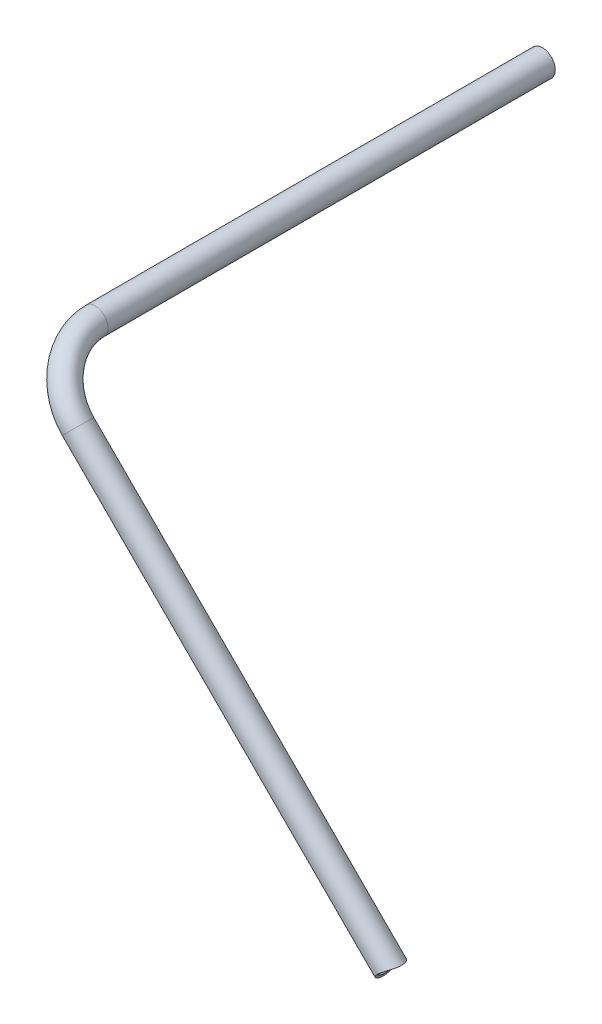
ISO-10303-21;
HEADER;
FILE_DESCRIPTION(('STEP AP214'),'2;1');
FILE_NAME('part.step','',(''),(''),'','','');
FILE_SCHEMA(('AUTOMOTIVE_DESIGN { 1 0 10303 214 1 1 1 1 }'));
ENDSEC;
DATA;
#1=APPLICATION_CONTEXT('core data for automotive mechanical design processes');
#2=APPLICATION_PROTOCOL_DEFINITION('international standard','automotive_design',2000,#1);
#3=PRODUCT_CONTEXT('',#1,'mechanical');
#4=PRODUCT('Part','Part','',(#3));
#5=PRODUCT_RELATED_PRODUCT_CATEGORY('part','',(#4));
#6=PRODUCT_DEFINITION_FORMATION('','',#4);
#7=PRODUCT_DEFINITION_CONTEXT('part definition',#1,'design');
#8=PRODUCT_DEFINITION('design','',#6,#7);
#9=PRODUCT_DEFINITION_SHAPE('','',#8);
#10=(LENGTH_UNIT() NAMED_UNIT(*) SI_UNIT(.MILLI.,.METRE.));
#11=(NAMED_UNIT(*) PLANE_ANGLE_UNIT() SI_UNIT($,.RADIAN.));
#12=(NAMED_UNIT(*) SI_UNIT($,.STERADIAN.) SOLID_ANGLE_UNIT());
#13=UNCERTAINTY_MEASURE_WITH_UNIT(LENGTH_MEASURE(1.E-05),#10,'distance_accuracy_value','');
#14=(GEOMETRIC_REPRESENTATION_CONTEXT(3) GLOBAL_UNCERTAINTY_ASSIGNED_CONTEXT((#13)) GLOBAL_UNIT_ASSIGNED_CONTEXT((#10,
#11,#12)) REPRESENTATION_CONTEXT('',''));
#15=CARTESIAN_POINT('',(0.,0.,0.));
#16=DIRECTION('',(0.,0.,1.));
#17=DIRECTION('',(1.,0.,0.));
#18=AXIS2_PLACEMENT_3D('',#15,#16,#17);
#19=CARTESIAN_POINT('',(388.537786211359,-388.537786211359,525.326301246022));
#20=DIRECTION('',(-0.707106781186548,0.707106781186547,0.));
#21=DIRECTION('',(-0.707106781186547,-0.707106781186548,0.));
#22=AXIS2_PLACEMENT_3D('',#19,#20,#21);
#23=CYLINDRICAL_SURFACE('',#22,13.3349999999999);
#24=CARTESIAN_POINT('',(43.1052293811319,-43.1052293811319,525.326301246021));
#25=DIRECTION('',(0.707106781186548,-0.707106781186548,0.));
#26=DIRECTION('',(0.500000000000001,0.5,-0.707106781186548));
#27=AXIS2_PLACEMENT_3D('',#24,#25,#26);
#28=CIRCLE('',#27,13.335);
#29=CARTESIAN_POINT('',(43.1052293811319,-43.1052293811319,538.661301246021));
#30=VERTEX_POINT('',#29);
#31=EDGE_CURVE('E50',#30,#30,#28,.T.);
#32=ORIENTED_EDGE('',*,*,#31,.T.);
#33=EDGE_LOOP('',(#32));
#34=FACE_BOUND('',#33,.T.);
#35=CARTESIAN_POINT('',(378.786480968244,-359.927943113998,525.326301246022));
#36=CARTESIAN_POINT('',(378.786476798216,-359.927942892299,524.972757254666));
#37=CARTESIAN_POINT('',(378.771620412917,-359.932994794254,524.619113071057));
#38=CARTESIAN_POINT('',(378.712467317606,-359.953260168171,523.914436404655));
#39=CARTESIAN_POINT('',(378.668152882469,-359.968479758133,523.563405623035));
#40=CARTESIAN_POINT('',(378.55080796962,-360.00928814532,522.865966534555));
#41=CARTESIAN_POINT('',(378.477712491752,-360.034900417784,522.519570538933));
#42=CARTESIAN_POINT('',(378.30418213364,-360.096743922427,521.834740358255));
#43=CARTESIAN_POINT('',(378.203751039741,-360.132973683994,521.496305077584));
#44=CARTESIAN_POINT('',(377.97777558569,-360.216210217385,520.831004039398));
#45=CARTESIAN_POINT('',(377.852344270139,-360.263168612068,520.504093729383));
#46=CARTESIAN_POINT('',(377.578031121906,-360.368362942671,519.862152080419));
#47=CARTESIAN_POINT('',(377.429148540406,-360.426599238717,519.547121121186));
#48=CARTESIAN_POINT('',(377.110073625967,-360.554791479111,518.930717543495));
#49=CARTESIAN_POINT('',(376.939890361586,-360.624742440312,518.629339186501));
#50=CARTESIAN_POINT('',(376.580219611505,-360.776917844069,518.041435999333));
#51=CARTESIAN_POINT('',(376.390725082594,-360.859146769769,517.754916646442));
#52=CARTESIAN_POINT('',(375.982044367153,-361.042011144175,517.180503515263));
#53=CARTESIAN_POINT('',(375.761737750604,-361.143482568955,516.893672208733));
#54=CARTESIAN_POINT('',(375.304266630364,-361.361523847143,516.339871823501));
#55=CARTESIAN_POINT('',(375.067101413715,-361.478094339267,516.072903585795));
#56=CARTESIAN_POINT('',(374.578273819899,-361.726998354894,515.560113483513));
#57=CARTESIAN_POINT('',(374.326603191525,-361.859340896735,515.314303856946));
#58=CARTESIAN_POINT('',(373.811479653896,-362.14019172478,514.845517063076));
#59=CARTESIAN_POINT('',(373.548030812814,-362.288694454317,514.622532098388));
#60=CARTESIAN_POINT('',(372.998369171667,-362.610119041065,514.190193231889));
#61=CARTESIAN_POINT('',(372.71167672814,-362.783890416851,513.982077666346));
#62=CARTESIAN_POINT('',(372.130950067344,-363.149903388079,513.594196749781));
#63=CARTESIAN_POINT('',(371.836915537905,-363.342145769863,513.414432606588));
#64=CARTESIAN_POINT('',(371.244688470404,-363.74488380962,513.084998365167));
#65=CARTESIAN_POINT('',(370.946497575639,-363.95537241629,512.935316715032));
#66=CARTESIAN_POINT('',(370.349003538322,-364.394120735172,512.667548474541));
#67=CARTESIAN_POINT('',(370.049700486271,-364.62237903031,512.549459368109));
#68=CARTESIAN_POINT('',(369.47031871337,-365.082050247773,512.352094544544));
#69=CARTESIAN_POINT('',(369.190124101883,-365.312527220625,512.270977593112));
#70=CARTESIAN_POINT('',(368.63420767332,-365.78713399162,512.13894395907));
#71=CARTESIAN_POINT('',(368.358485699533,-366.031263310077,512.088026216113));
#72=CARTESIAN_POINT('',(367.814165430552,-366.531442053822,512.017014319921));
#73=CARTESIAN_POINT('',(367.54556440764,-366.787486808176,511.996908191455));
#74=CARTESIAN_POINT('',(367.017737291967,-367.309589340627,511.987731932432));
#75=CARTESIAN_POINT('',(366.758510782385,-367.575646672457,511.998660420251));
#76=CARTESIAN_POINT('',(366.268813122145,-368.097066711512,512.049609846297));
#77=CARTESIAN_POINT('',(366.03758643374,-368.351921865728,512.087596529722));
#78=CARTESIAN_POINT('',(365.586503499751,-368.866316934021,512.189986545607));
#79=CARTESIAN_POINT('',(365.366646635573,-369.125856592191,512.254388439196));
#80=CARTESIAN_POINT('',(364.939421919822,-369.647525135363,512.40896235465));
#81=CARTESIAN_POINT('',(364.73205448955,-369.909654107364,512.499135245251));
#82=CARTESIAN_POINT('',(364.33064269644,-370.43434993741,512.704401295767));
#83=CARTESIAN_POINT('',(364.13659875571,-370.69691680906,512.819495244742));
#84=CARTESIAN_POINT('',(363.759536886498,-371.224319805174,513.075538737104));
#85=CARTESIAN_POINT('',(363.576731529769,-371.489129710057,513.216854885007));
#86=CARTESIAN_POINT('',(363.225711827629,-372.014776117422,513.523000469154));
#87=CARTESIAN_POINT('',(363.057497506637,-372.275612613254,513.687829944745));
#88=CARTESIAN_POINT('',(362.735689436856,-372.791191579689,514.039835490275));
#89=CARTESIAN_POINT('',(362.582097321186,-373.045933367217,514.22701405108));
#90=CARTESIAN_POINT('',(362.289352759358,-373.547284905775,514.622577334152));
#91=CARTESIAN_POINT('',(362.150205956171,-373.793891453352,514.830970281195));
#92=CARTESIAN_POINT('',(361.87587783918,-374.295537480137,515.284657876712));
#93=CARTESIAN_POINT('',(361.741839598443,-374.549749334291,515.531560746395));
#94=CARTESIAN_POINT('',(361.489742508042,-375.043665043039,516.047085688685));
#95=CARTESIAN_POINT('',(361.371684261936,-375.283368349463,516.315708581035));
#96=CARTESIAN_POINT('',(361.150897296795,-375.745793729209,516.873322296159));
#97=CARTESIAN_POINT('',(361.048174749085,-375.968508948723,517.162321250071));
#98=CARTESIAN_POINT('',(360.857450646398,-376.394288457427,517.759126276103));
#99=CARTESIAN_POINT('',(360.769451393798,-376.597349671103,518.066935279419));
#100=CARTESIAN_POINT('',(360.604223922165,-376.989011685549,518.712651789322));
#101=CARTESIAN_POINT('',(360.527582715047,-377.176682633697,519.051275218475));
#102=CARTESIAN_POINT('',(360.388881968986,-377.52482171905,519.744917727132));
#103=CARTESIAN_POINT('',(360.326815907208,-377.685302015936,520.099929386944));
#104=CARTESIAN_POINT('',(360.216606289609,-377.976249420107,520.823983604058));
#105=CARTESIAN_POINT('',(360.168456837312,-378.106729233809,521.193020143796));
#106=CARTESIAN_POINT('',(360.085510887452,-378.335143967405,521.942491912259));
#107=CARTESIAN_POINT('',(360.050713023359,-378.433082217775,522.322925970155));
#108=CARTESIAN_POINT('',(359.996036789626,-378.588619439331,523.065066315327));
#109=CARTESIAN_POINT('',(359.975283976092,-378.648563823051,523.426217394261));
#110=CARTESIAN_POINT('',(359.944738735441,-378.737228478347,524.152795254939));
#111=CARTESIAN_POINT('',(359.934945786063,-378.76595023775,524.518221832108));
#112=CARTESIAN_POINT('',(359.926212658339,-378.791550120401,525.250184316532));
#113=CARTESIAN_POINT('',(359.927268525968,-378.788439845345,525.61671977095));
#114=CARTESIAN_POINT('',(359.940235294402,-378.750469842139,526.347938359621));
#115=CARTESIAN_POINT('',(359.952145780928,-378.715611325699,526.712621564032));
#116=CARTESIAN_POINT('',(359.985632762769,-378.618713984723,527.409679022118));
#117=CARTESIAN_POINT('',(360.006409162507,-378.558932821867,527.742408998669));
#118=CARTESIAN_POINT('',(360.057535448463,-378.413938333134,528.401502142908));
#119=CARTESIAN_POINT('',(360.087884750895,-378.328726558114,528.727865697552));
#120=CARTESIAN_POINT('',(360.158423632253,-378.134251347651,529.372241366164));
#121=CARTESIAN_POINT('',(360.198613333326,-378.024987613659,529.690253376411));
#122=CARTESIAN_POINT('',(360.289183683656,-377.783991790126,530.31627542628));
#123=CARTESIAN_POINT('',(360.339568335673,-377.652250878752,530.624281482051));
#124=CARTESIAN_POINT('',(360.453365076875,-377.361841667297,531.241939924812));
#125=CARTESIAN_POINT('',(360.517253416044,-377.20224256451,531.551066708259));
#126=CARTESIAN_POINT('',(360.657078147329,-376.862559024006,532.155170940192));
#127=CARTESIAN_POINT('',(360.733019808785,-376.682465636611,532.450142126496));
#128=CARTESIAN_POINT('',(360.8974737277,-376.303948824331,533.024471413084));
#129=CARTESIAN_POINT('',(360.985988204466,-376.105522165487,533.303826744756));
#130=CARTESIAN_POINT('',(361.176115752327,-375.692485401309,533.845609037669));
#131=CARTESIAN_POINT('',(361.277729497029,-375.477874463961,534.108035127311));
#132=CARTESIAN_POINT('',(361.504737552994,-375.013801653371,534.638483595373));
#133=CARTESIAN_POINT('',(361.631467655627,-374.762958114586,534.904729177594));
#134=CARTESIAN_POINT('',(361.901788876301,-374.247249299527,535.413869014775));
#135=CARTESIAN_POINT('',(362.045374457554,-373.982388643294,535.656770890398));
#136=CARTESIAN_POINT('',(362.349992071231,-373.441198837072,536.117844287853));
#137=CARTESIAN_POINT('',(362.511030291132,-373.16486564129,536.336006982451));
#138=CARTESIAN_POINT('',(362.850814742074,-372.603603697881,536.745900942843));
#139=CARTESIAN_POINT('',(363.029560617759,-372.318675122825,536.937632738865));
#140=CARTESIAN_POINT('',(363.406288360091,-371.740799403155,537.29446974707));
#141=CARTESIAN_POINT('',(363.60441025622,-371.447806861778,537.459354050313));
#142=CARTESIAN_POINT('',(364.018407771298,-370.858966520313,537.759070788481));
#143=CARTESIAN_POINT('',(364.234283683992,-370.563118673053,537.893902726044));
#144=CARTESIAN_POINT('',(364.682954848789,-369.971802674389,538.131985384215));
#145=CARTESIAN_POINT('',(364.915740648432,-369.676334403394,538.235253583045));
#146=CARTESIAN_POINT('',(365.39715952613,-369.088706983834,538.409069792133));
#147=CARTESIAN_POINT('',(365.645791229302,-368.796547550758,538.479620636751));
#148=CARTESIAN_POINT('',(366.137616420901,-368.240730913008,538.582983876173));
#149=CARTESIAN_POINT('',(366.379763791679,-367.976606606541,538.618276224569));
#150=CARTESIAN_POINT('',(366.874510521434,-367.455981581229,538.65980981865));
#151=CARTESIAN_POINT('',(367.127109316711,-367.199480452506,538.666052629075));
#152=CARTESIAN_POINT('',(367.640776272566,-366.696189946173,538.64941768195));
#153=CARTESIAN_POINT('',(367.901842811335,-366.44939872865,538.626545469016));
#154=CARTESIAN_POINT('',(368.430327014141,-365.967250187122,538.551954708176));
#155=CARTESIAN_POINT('',(368.697744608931,-365.731892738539,538.500236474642));
#156=CARTESIAN_POINT('',(369.224912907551,-365.284003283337,538.371394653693));
#157=CARTESIAN_POINT('',(369.484493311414,-365.070924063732,538.295469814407));
#158=CARTESIAN_POINT('',(370.00523024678,-364.657544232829,538.118496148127));
#159=CARTESIAN_POINT('',(370.266386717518,-364.457243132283,538.017448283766));
#160=CARTESIAN_POINT('',(370.788194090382,-364.070080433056,537.791123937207));
#161=CARTESIAN_POINT('',(371.048844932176,-363.883220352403,537.6658447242));
#162=CARTESIAN_POINT('',(371.567523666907,-363.523372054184,537.392090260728));
#163=CARTESIAN_POINT('',(371.825551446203,-363.350384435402,537.243614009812));
#164=CARTESIAN_POINT('',(372.348598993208,-363.010881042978,536.91727856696));
#165=CARTESIAN_POINT('',(372.613400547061,-362.845020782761,536.73838775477));
#166=CARTESIAN_POINT('',(373.135678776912,-362.528567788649,536.357667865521));
#167=CARTESIAN_POINT('',(373.393152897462,-362.37798033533,536.155830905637));
#168=CARTESIAN_POINT('',(373.898493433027,-362.091869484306,535.730511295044));
#169=CARTESIAN_POINT('',(374.146358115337,-361.956348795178,535.507024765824));
#170=CARTESIAN_POINT('',(374.630231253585,-361.700014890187,535.039698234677));
#171=CARTESIAN_POINT('',(374.866239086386,-361.579202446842,534.795857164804));
#172=CARTESIAN_POINT('',(375.342017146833,-361.342958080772,534.269353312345));
#173=CARTESIAN_POINT('',(375.580652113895,-361.228675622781,533.98514614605));
#174=CARTESIAN_POINT('',(376.038738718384,-361.016001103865,533.396233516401));
#175=CARTESIAN_POINT('',(376.258196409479,-360.91760402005,533.091534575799));
#176=CARTESIAN_POINT('',(376.67540122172,-360.73586669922,532.462937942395));
#177=CARTESIAN_POINT('',(376.873129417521,-360.652539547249,532.139023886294));
#178=CARTESIAN_POINT('',(377.243817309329,-360.500355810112,531.474078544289));
#179=CARTESIAN_POINT('',(377.416778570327,-360.431498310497,531.133048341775));
#180=CARTESIAN_POINT('',(377.735581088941,-360.307433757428,530.434997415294));
#181=CARTESIAN_POINT('',(377.881349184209,-360.252263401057,530.077936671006));
#182=CARTESIAN_POINT('',(378.142552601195,-360.155227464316,529.351028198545));
#183=CARTESIAN_POINT('',(378.25798270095,-360.113364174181,528.981178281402));
#184=CARTESIAN_POINT('',(378.455823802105,-360.042591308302,528.232724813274));
#185=CARTESIAN_POINT('',(378.538332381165,-360.013643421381,527.854150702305));
#186=CARTESIAN_POINT('',(378.66893938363,-359.968190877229,527.090572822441));
#187=CARTESIAN_POINT('',(378.717063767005,-359.951676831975,526.705574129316));
#188=CARTESIAN_POINT('',(378.760454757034,-359.936824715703,526.154045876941));
#189=CARTESIAN_POINT('',(378.770208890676,-359.933493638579,525.988676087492));
#190=CARTESIAN_POINT('',(378.783223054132,-359.929052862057,525.657645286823));
#191=CARTESIAN_POINT('',(378.786482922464,-359.927943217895,525.491984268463));
#192=CARTESIAN_POINT('',(378.786480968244,-359.927943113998,525.326301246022));
#193=B_SPLINE_CURVE_WITH_KNOTS('',3,(#35,#36,#37,#38,#39,#40,#41,#42,#43,#44,#45,#46,#47,#48,
#49,#50,#51,#52,#53,#54,#55,#56,#57,#58,#59,#60,#61,#62,#63,#64,#65,#66,#67,#68,#69,#70,#71,#72,
#73,#74,#75,#76,#77,#78,#79,#80,#81,#82,#83,#84,#85,#86,#87,#88,#89,#90,#91,#92,#93,#94,#95,#96,
#97,#98,#99,#100,#101,#102,#103,#104,#105,#106,#107,#108,#109,#110,#111,#112,#113,#114,#115,
#116,#117,#118,#119,#120,#121,#122,#123,#124,#125,#126,#127,#128,#129,#130,#131,#132,#133,#134,
#135,#136,#137,#138,#139,#140,#141,#142,#143,#144,#145,#146,#147,#148,#149,#150,#151,#152,#153,
#154,#155,#156,#157,#158,#159,#160,#161,#162,#163,#164,#165,#166,#167,#168,#169,#170,#171,#172,
#173,#174,#175,#176,#177,#178,#179,#180,#181,#182,#183,#184,#185,#186,#187,#188,#189,#190,#191,
#192),.UNSPECIFIED.,.T.,.F.,(4,2,2,2,2,2,2,2,2,2,2,2,2,2,2,2,2,2,2,2,2,2,2,2,2,2,2,2,2,2,2,2,2,
2,2,2,2,2,2,2,2,2,2,2,2,2,2,2,2,2,2,2,2,2,2,2,2,2,2,2,2,2,2,2,2,2,2,2,2,2,2,2,2,2,2,2,2,2,4),
(0.,1.06046028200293,2.12155922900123,3.18506847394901,4.24843048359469,5.30708908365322,
6.36578149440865,7.42402470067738,8.48265526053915,9.60834023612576,10.7340728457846,
11.860452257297,12.9864455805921,14.1687172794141,15.3510393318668,16.5329064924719,
17.7146794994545,18.8285054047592,19.9422921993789,21.055646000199,22.1689502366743,
23.2063519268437,24.2436971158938,25.2810772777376,26.318490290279,27.371680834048,
28.4248731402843,29.4781829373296,30.5319026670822,31.6672855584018,32.8027113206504,
33.9385927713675,35.0746516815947,36.2571292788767,37.4390766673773,38.6205225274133,
39.801847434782,40.9004103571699,41.9989209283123,43.0970311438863,44.1950994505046,
45.2100319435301,46.2249025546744,47.2397857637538,48.2550682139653,49.3150925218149,
50.3755815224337,51.436257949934,52.4969889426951,53.6570410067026,54.8167130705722,
55.9767976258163,57.1368589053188,58.3060296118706,59.475219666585,60.6437611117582,
61.8122013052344,62.8910022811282,63.9697451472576,65.0482826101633,66.1268083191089,
67.1585714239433,68.1902950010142,69.2221349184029,70.2540193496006,71.33298987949,
72.412332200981,73.491868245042,74.5714609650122,75.7350282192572,76.898226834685,
78.0624306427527,79.2265608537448,80.3937793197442,81.5611985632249,82.72513146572,
83.8881846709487,84.3851409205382,84.8821095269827),.UNSPECIFIED.);
#194=CARTESIAN_POINT('',(378.786480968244,-359.927943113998,525.326301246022));
#195=VERTEX_POINT('',#194);
#196=EDGE_CURVE('E59',#195,#195,#193,.T.);
#197=ORIENTED_EDGE('',*,*,#196,.T.);
#198=EDGE_LOOP('',(#197));
#199=FACE_BOUND('',#198,.T.);
#200=ADVANCED_FACE('F29',(#34,#199),#23,.T.);
#201=CARTESIAN_POINT('',(388.537786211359,-388.537786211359,525.326301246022));
#202=DIRECTION('',(-0.707106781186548,0.707106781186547,0.));
#203=DIRECTION('',(-0.707106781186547,-0.707106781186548,0.));
#204=AXIS2_PLACEMENT_3D('',#201,#202,#203);
#205=CYLINDRICAL_SURFACE('',#204,10.4648);
#206=CARTESIAN_POINT('',(43.1052293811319,-43.1052293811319,525.326301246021));
#207=DIRECTION('',(0.707106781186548,-0.707106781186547,0.));
#208=DIRECTION('',(0.707106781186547,0.707106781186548,0.));
#209=AXIS2_PLACEMENT_3D('',#206,#207,#208);
#210=CIRCLE('',#209,10.4648);
#211=CARTESIAN_POINT('',(43.1052293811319,-43.1052293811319,535.791101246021));
#212=VERTEX_POINT('',#211);
#213=EDGE_CURVE('E56',#212,#212,#210,.T.);
#214=ORIENTED_EDGE('',*,*,#213,.F.);
#215=EDGE_LOOP('',(#214));
#216=FACE_BOUND('',#215,.T.);
#217=CARTESIAN_POINT('',(361.086882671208,-375.88634475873,525.326301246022));
#218=CARTESIAN_POINT('',(361.086882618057,-375.886345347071,525.042021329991));
#219=CARTESIAN_POINT('',(361.092049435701,-375.8751160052,524.757748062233));
#220=CARTESIAN_POINT('',(361.112731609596,-375.830384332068,524.191347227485));
#221=CARTESIAN_POINT('',(361.128246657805,-375.796882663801,523.909219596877));
#222=CARTESIAN_POINT('',(361.169672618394,-375.708139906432,523.349165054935));
#223=CARTESIAN_POINT('',(361.195584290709,-375.652897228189,523.071238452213));
#224=CARTESIAN_POINT('',(361.257880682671,-375.521523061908,522.521569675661));
#225=CARTESIAN_POINT('',(361.294265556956,-375.445391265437,522.249827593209));
#226=CARTESIAN_POINT('',(361.377517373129,-375.273550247,521.714979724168));
#227=CARTESIAN_POINT('',(361.424359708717,-375.17788702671,521.451855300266));
#228=CARTESIAN_POINT('',(361.528725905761,-374.968134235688,520.935138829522));
#229=CARTESIAN_POINT('',(361.586253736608,-374.854037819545,520.681550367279));
#230=CARTESIAN_POINT('',(361.712131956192,-374.608883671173,520.185517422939));
#231=CARTESIAN_POINT('',(361.780482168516,-374.477826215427,519.943072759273));
#232=CARTESIAN_POINT('',(361.928174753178,-374.200270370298,519.470682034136));
#233=CARTESIAN_POINT('',(362.0075178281,-374.053770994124,519.240736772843));
#234=CARTESIAN_POINT('',(362.180620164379,-373.741029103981,518.786057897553));
#235=CARTESIAN_POINT('',(362.274815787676,-373.574244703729,518.561862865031));
#236=CARTESIAN_POINT('',(362.475399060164,-373.227555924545,518.129653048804));
#237=CARTESIAN_POINT('',(362.581786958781,-373.04765127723,517.921638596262));
#238=CARTESIAN_POINT('',(362.806893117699,-372.676534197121,517.523013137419));
#239=CARTESIAN_POINT('',(362.925613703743,-372.4853196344,517.332405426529));
#240=CARTESIAN_POINT('',(363.175403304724,-372.09349903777,516.969858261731));
#241=CARTESIAN_POINT('',(363.306471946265,-371.892893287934,516.797918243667));
#242=CARTESIAN_POINT('',(363.584835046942,-371.478319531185,516.469213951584));
#243=CARTESIAN_POINT('',(363.732487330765,-371.264133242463,516.313027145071));
#244=CARTESIAN_POINT('',(364.040487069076,-370.830042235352,516.022922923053));
#245=CARTESIAN_POINT('',(364.200829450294,-370.610139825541,515.888996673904));
#246=CARTESIAN_POINT('',(364.533810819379,-370.166691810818,515.644480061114));
#247=CARTESIAN_POINT('',(364.706449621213,-369.943146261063,515.533889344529));
#248=CARTESIAN_POINT('',(365.063330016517,-369.494595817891,515.337069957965));
#249=CARTESIAN_POINT('',(365.247571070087,-369.269590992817,515.250840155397));
#250=CARTESIAN_POINT('',(365.619621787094,-368.828679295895,515.106343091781));
#251=CARTESIAN_POINT('',(365.807042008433,-368.612746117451,515.04715279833));
#252=CARTESIAN_POINT('',(366.190648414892,-368.183441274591,514.952716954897));
#253=CARTESIAN_POINT('',(366.386834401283,-367.970069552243,514.917470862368));
#254=CARTESIAN_POINT('',(366.786596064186,-367.547757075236,514.8712858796));
#255=CARTESIAN_POINT('',(366.99016996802,-367.338815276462,514.860341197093));
#256=CARTESIAN_POINT('',(367.403215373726,-366.927001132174,514.862855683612));
#257=CARTESIAN_POINT('',(367.612686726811,-366.724128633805,514.876314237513));
#258=CARTESIAN_POINT('',(368.026857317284,-366.334401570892,514.926408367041));
#259=CARTESIAN_POINT('',(368.231383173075,-366.147232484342,514.962038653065));
#260=CARTESIAN_POINT('',(368.642671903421,-365.780999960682,515.055216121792));
#261=CARTESIAN_POINT('',(368.849434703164,-365.601936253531,515.112762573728));
#262=CARTESIAN_POINT('',(369.263537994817,-365.252860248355,515.249260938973));
#263=CARTESIAN_POINT('',(369.470878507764,-365.082848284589,515.328213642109));
#264=CARTESIAN_POINT('',(369.884431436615,-364.752634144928,515.506856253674));
#265=CARTESIAN_POINT('',(370.090643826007,-364.59243219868,515.606546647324));
#266=CARTESIAN_POINT('',(370.502981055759,-364.280320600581,515.827347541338));
#267=CARTESIAN_POINT('',(370.709067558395,-364.128551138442,515.948727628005));
#268=CARTESIAN_POINT('',(371.116637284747,-363.836012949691,516.21110479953));
#269=CARTESIAN_POINT('',(371.318118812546,-363.695248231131,516.352108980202));
#270=CARTESIAN_POINT('',(371.714677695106,-363.425007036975,516.652726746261));
#271=CARTESIAN_POINT('',(371.90975475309,-363.295531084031,516.812341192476));
#272=CARTESIAN_POINT('',(372.291800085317,-363.047967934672,517.149153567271));
#273=CARTESIAN_POINT('',(372.478767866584,-362.929881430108,517.326352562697));
#274=CARTESIAN_POINT('',(372.852123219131,-362.699411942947,517.70665075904));
#275=CARTESIAN_POINT('',(373.038003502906,-362.587619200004,517.910606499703));
#276=CARTESIAN_POINT('',(373.397045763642,-362.376508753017,518.335472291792));
#277=CARTESIAN_POINT('',(373.570207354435,-362.277191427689,518.556382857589));
#278=CARTESIAN_POINT('',(373.901962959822,-362.090858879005,519.013866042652));
#279=CARTESIAN_POINT('',(374.060553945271,-362.003846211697,519.25044190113));
#280=CARTESIAN_POINT('',(374.361275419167,-361.841966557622,519.73777632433));
#281=CARTESIAN_POINT('',(374.50340663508,-361.76709903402,519.988534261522));
#282=CARTESIAN_POINT('',(374.771664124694,-361.628156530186,520.507013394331));
#283=CARTESIAN_POINT('',(374.897482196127,-361.564283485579,520.774948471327));
#284=CARTESIAN_POINT('',(375.128443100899,-361.448724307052,521.321995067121));
#285=CARTESIAN_POINT('',(375.233594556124,-361.397033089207,521.601101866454));
#286=CARTESIAN_POINT('',(375.421669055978,-361.305645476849,522.168576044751));
#287=CARTESIAN_POINT('',(375.504595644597,-361.265947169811,522.456941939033));
#288=CARTESIAN_POINT('',(375.64687750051,-361.198404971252,523.040789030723));
#289=CARTESIAN_POINT('',(375.706234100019,-361.170560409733,523.336269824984));
#290=CARTESIAN_POINT('',(375.798079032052,-361.127689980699,523.917609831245));
#291=CARTESIAN_POINT('',(375.831725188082,-361.112110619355,524.203245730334));
#292=CARTESIAN_POINT('',(375.876186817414,-361.091555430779,524.776666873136));
#293=CARTESIAN_POINT('',(375.887003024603,-361.086579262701,525.064452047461));
#294=CARTESIAN_POINT('',(375.885624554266,-361.087214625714,525.639902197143));
#295=CARTESIAN_POINT('',(375.873433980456,-361.092824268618,525.927567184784));
#296=CARTESIAN_POINT('',(375.826253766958,-361.114644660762,526.500611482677));
#297=CARTESIAN_POINT('',(375.791264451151,-361.130855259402,526.785990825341));
#298=CARTESIAN_POINT('',(375.700831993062,-361.173099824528,527.341446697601));
#299=CARTESIAN_POINT('',(375.646224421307,-361.198733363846,527.611690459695));
#300=CARTESIAN_POINT('',(375.517231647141,-361.259932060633,528.146365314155));
#301=CARTESIAN_POINT('',(375.442839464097,-361.295500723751,528.410794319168));
#302=CARTESIAN_POINT('',(375.275332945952,-361.376654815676,528.931996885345));
#303=CARTESIAN_POINT('',(375.182222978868,-361.422237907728,529.188772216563));
#304=CARTESIAN_POINT('',(374.978435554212,-361.523567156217,529.693291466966));
#305=CARTESIAN_POINT('',(374.867751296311,-361.579317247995,529.94103184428));
#306=CARTESIAN_POINT('',(374.626231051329,-361.70313096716,530.434017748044));
#307=CARTESIAN_POINT('',(374.494848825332,-361.771541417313,530.678908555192));
#308=CARTESIAN_POINT('',(374.216280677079,-361.919551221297,531.156137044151));
#309=CARTESIAN_POINT('',(374.069087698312,-361.999155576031,531.388469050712));
#310=CARTESIAN_POINT('',(373.760559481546,-362.169704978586,531.83917794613));
#311=CARTESIAN_POINT('',(373.599223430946,-362.260650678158,532.057554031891));
#312=CARTESIAN_POINT('',(373.264076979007,-362.454030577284,532.479121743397));
#313=CARTESIAN_POINT('',(373.090266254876,-362.556465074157,532.682312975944));
#314=CARTESIAN_POINT('',(372.722384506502,-362.778657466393,533.082661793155));
#315=CARTESIAN_POINT('',(372.527728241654,-362.899044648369,533.278933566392));
#316=CARTESIAN_POINT('',(372.12853766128,-363.152681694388,533.651989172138));
#317=CARTESIAN_POINT('',(371.924006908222,-363.285926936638,533.82877995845));
#318=CARTESIAN_POINT('',(371.506951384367,-363.565306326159,534.16177267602));
#319=CARTESIAN_POINT('',(371.294423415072,-363.711445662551,534.317966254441));
#320=CARTESIAN_POINT('',(370.86362134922,-364.016274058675,534.608415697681));
#321=CARTESIAN_POINT('',(370.645349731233,-364.174957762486,534.742680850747));
#322=CARTESIAN_POINT('',(370.206335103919,-364.50356645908,534.987532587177));
#323=CARTESIAN_POINT('',(369.985613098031,-364.673422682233,535.09824899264));
#324=CARTESIAN_POINT('',(369.542592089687,-365.02452297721,535.295963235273));
#325=CARTESIAN_POINT('',(369.320293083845,-365.205767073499,535.382961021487));
#326=CARTESIAN_POINT('',(368.876293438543,-365.578674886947,535.532371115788));
#327=CARTESIAN_POINT('',(368.654592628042,-365.77033519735,535.594791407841));
#328=CARTESIAN_POINT('',(368.213782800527,-366.162955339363,535.694444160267));
#329=CARTESIAN_POINT('',(367.994673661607,-366.363914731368,535.731677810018));
#330=CARTESIAN_POINT('',(367.571965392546,-366.763358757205,535.779331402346));
#331=CARTESIAN_POINT('',(367.36814155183,-366.961456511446,535.791009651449));
#332=CARTESIAN_POINT('',(366.966173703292,-367.363335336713,535.791191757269));
#333=CARTESIAN_POINT('',(366.768029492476,-367.567116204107,535.779696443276));
#334=CARTESIAN_POINT('',(366.378849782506,-367.978777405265,535.733647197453));
#335=CARTESIAN_POINT('',(366.187813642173,-368.186657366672,535.699095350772));
#336=CARTESIAN_POINT('',(365.814055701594,-368.604853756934,535.607267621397));
#337=CARTESIAN_POINT('',(365.631333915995,-368.815170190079,535.549991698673));
#338=CARTESIAN_POINT('',(365.278522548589,-369.232578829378,535.414514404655));
#339=CARTESIAN_POINT('',(365.108261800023,-369.439658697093,535.336719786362));
#340=CARTESIAN_POINT('',(364.777434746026,-369.852849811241,535.160380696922));
#341=CARTESIAN_POINT('',(364.616871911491,-370.058960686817,535.061828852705));
#342=CARTESIAN_POINT('',(364.306087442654,-370.468422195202,534.844781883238));
#343=CARTESIAN_POINT('',(364.155865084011,-370.671773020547,534.726288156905));
#344=CARTESIAN_POINT('',(363.866130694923,-371.074053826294,534.470218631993));
#345=CARTESIAN_POINT('',(363.726619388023,-371.272983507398,534.332641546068));
#346=CARTESIAN_POINT('',(363.453365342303,-371.672327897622,534.033670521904));
#347=CARTESIAN_POINT('',(363.320054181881,-371.872502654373,533.871561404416));
#348=CARTESIAN_POINT('',(363.065365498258,-372.26444929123,533.528868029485));
#349=CARTESIAN_POINT('',(362.943988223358,-372.456220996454,533.348283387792));
#350=CARTESIAN_POINT('',(362.713130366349,-372.829621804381,532.96971884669));
#351=CARTESIAN_POINT('',(362.603653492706,-373.011247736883,532.771733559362));
#352=CARTESIAN_POINT('',(362.39655586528,-373.362519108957,532.359600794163));
#353=CARTESIAN_POINT('',(362.298935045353,-373.532164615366,532.145453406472));
#354=CARTESIAN_POINT('',(362.111417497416,-373.864813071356,531.692589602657));
#355=CARTESIAN_POINT('',(362.022040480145,-374.02720739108,531.453210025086));
#356=CARTESIAN_POINT('',(361.85587930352,-374.335057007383,530.959774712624));
#357=CARTESIAN_POINT('',(361.779090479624,-374.480518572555,530.705724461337));
#358=CARTESIAN_POINT('',(361.637855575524,-374.752709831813,530.184452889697));
#359=CARTESIAN_POINT('',(361.573410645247,-374.87943778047,529.917230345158));
#360=CARTESIAN_POINT('',(361.456683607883,-375.112364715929,529.371418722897));
#361=CARTESIAN_POINT('',(361.404401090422,-375.218564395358,529.092830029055));
#362=CARTESIAN_POINT('',(361.312708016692,-375.407021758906,528.531618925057));
#363=CARTESIAN_POINT('',(361.273072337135,-375.489694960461,528.249172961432));
#364=CARTESIAN_POINT('',(361.20521909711,-375.632434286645,527.677273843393));
#365=CARTESIAN_POINT('',(361.177001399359,-375.692500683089,527.387820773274));
#366=CARTESIAN_POINT('',(361.131901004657,-375.789006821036,526.804232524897));
#367=CARTESIAN_POINT('',(361.1150142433,-375.825455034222,526.510099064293));
#368=CARTESIAN_POINT('',(361.092505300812,-375.874123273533,525.91940834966));
#369=CARTESIAN_POINT('',(361.086882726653,-375.886344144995,525.622851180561));
#370=CARTESIAN_POINT('',(361.086882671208,-375.88634475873,525.326301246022));
#371=B_SPLINE_CURVE_WITH_KNOTS('',3,(#217,#218,#219,#220,#221,#222,#223,#224,#225,#226,#227,
#228,#229,#230,#231,#232,#233,#234,#235,#236,#237,#238,#239,#240,#241,#242,#243,#244,#245,#246,
#247,#248,#249,#250,#251,#252,#253,#254,#255,#256,#257,#258,#259,#260,#261,#262,#263,#264,#265,
#266,#267,#268,#269,#270,#271,#272,#273,#274,#275,#276,#277,#278,#279,#280,#281,#282,#283,#284,
#285,#286,#287,#288,#289,#290,#291,#292,#293,#294,#295,#296,#297,#298,#299,#300,#301,#302,#303,
#304,#305,#306,#307,#308,#309,#310,#311,#312,#313,#314,#315,#316,#317,#318,#319,#320,#321,#322,
#323,#324,#325,#326,#327,#328,#329,#330,#331,#332,#333,#334,#335,#336,#337,#338,#339,#340,#341,
#342,#343,#344,#345,#346,#347,#348,#349,#350,#351,#352,#353,#354,#355,#356,#357,#358,#359,#360,
#361,#362,#363,#364,#365,#366,#367,#368,#369,#370),.UNSPECIFIED.,.T.,.F.,(4,2,2,2,2,2,2,2,2,2,2,
2,2,2,2,2,2,2,2,2,2,2,2,2,2,2,2,2,2,2,2,2,2,2,2,2,2,2,2,2,2,2,2,2,2,2,2,2,2,2,2,2,2,2,2,2,2,2,2,
2,2,2,2,2,2,2,2,2,2,2,2,2,2,2,2,2,4),(0.,0.852561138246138,1.70509689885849,2.55769498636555,
3.41030566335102,4.26093091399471,5.11187278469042,5.96280078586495,6.81378319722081,
7.69742048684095,8.58107585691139,9.46489817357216,10.3486937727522,11.257864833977,
12.1666742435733,13.0754699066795,13.9842233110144,14.8590802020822,15.7339172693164,
16.608545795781,17.4831522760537,18.3207333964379,19.1582865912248,19.9958706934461,
20.8334743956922,21.6823224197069,22.5314781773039,23.3806732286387,24.2299198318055,
25.1221045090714,26.0143162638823,26.9067130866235,27.7990704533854,28.7063852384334,
29.6133206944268,30.5201114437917,31.4268509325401,32.2898567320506,33.1528347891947,
34.0156589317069,34.8784708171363,35.7082048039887,36.5382319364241,37.3680655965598,
38.1982211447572,39.0558861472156,39.9139355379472,40.7720342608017,41.6301551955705,
42.533608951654,43.4367391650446,44.3402345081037,45.243346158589,46.1413420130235,
47.0393397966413,47.9370456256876,48.8347090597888,49.687072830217,50.539406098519,
51.3916622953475,52.2439199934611,53.0804098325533,53.917197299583,54.7539260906,
55.5907113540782,56.4598493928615,57.3290055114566,58.198431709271,59.0678530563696,
59.975040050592,60.8818901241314,61.7888246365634,62.6957285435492,63.5854487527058,
64.4751582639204,65.3645484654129,66.2539076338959),.UNSPECIFIED.);
#372=CARTESIAN_POINT('',(361.086882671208,-375.88634475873,525.326301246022));
#373=VERTEX_POINT('',#372);
#374=EDGE_CURVE('E33',#373,#373,#371,.T.);
#375=ORIENTED_EDGE('',*,*,#374,.T.);
#376=EDGE_LOOP('',(#375));
#377=FACE_BOUND('',#376,.T.);
#378=ADVANCED_FACE('F80',(#216,#377),#205,.F.);
#379=CARTESIAN_POINT('',(0.,0.,0.));
#380=DIRECTION('',(0.,0.,1.));
#381=DIRECTION('',(1.,0.,0.));
#382=AXIS2_PLACEMENT_3D('',#379,#380,#381);
#383=PLANE('',#382);
#384=CARTESIAN_POINT('',(0.,0.,0.));
#385=DIRECTION('',(0.,0.,1.));
#386=DIRECTION('',(1.,0.,0.));
#387=AXIS2_PLACEMENT_3D('',#384,#385,#386);
#388=CIRCLE('',#387,13.335);
#389=CARTESIAN_POINT('',(13.335,0.,0.));
#390=VERTEX_POINT('',#389);
#391=EDGE_CURVE('E41',#390,#390,#388,.T.);
#392=ORIENTED_EDGE('',*,*,#391,.F.);
#393=EDGE_LOOP('',(#392));
#394=FACE_BOUND('',#393,.T.);
#395=CARTESIAN_POINT('',(0.,0.,0.));
#396=DIRECTION('',(0.,0.,1.));
#397=DIRECTION('',(1.,0.,0.));
#398=AXIS2_PLACEMENT_3D('',#395,#396,#397);
#399=CIRCLE('',#398,10.4648);
#400=CARTESIAN_POINT('',(10.4648,0.,0.));
#401=VERTEX_POINT('',#400);
#402=EDGE_CURVE('E46',#401,#401,#399,.T.);
#403=ORIENTED_EDGE('',*,*,#402,.T.);
#404=EDGE_LOOP('',(#403));
#405=FACE_BOUND('',#404,.T.);
#406=ADVANCED_FACE('F86',(#394,#405),#383,.F.);
#407=CARTESIAN_POINT('',(0.,0.,464.366301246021));
#408=DIRECTION('',(0.,0.,-1.));
#409=DIRECTION('',(-1.,0.,0.));
#410=AXIS2_PLACEMENT_3D('',#407,#408,#409);
#411=CYLINDRICAL_SURFACE('',#410,13.335);
#412=CARTESIAN_POINT('',(0.,0.,464.366301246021));
#413=DIRECTION('',(0.,0.,1.));
#414=DIRECTION('',(1.,0.,0.));
#415=AXIS2_PLACEMENT_3D('',#412,#413,#414);
#416=CIRCLE('',#415,13.335);
#417=CARTESIAN_POINT('',(-9.42926892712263,9.42926892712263,464.366301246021));
#418=VERTEX_POINT('',#417);
#419=EDGE_CURVE('E10',#418,#418,#416,.T.);
#420=ORIENTED_EDGE('',*,*,#419,.F.);
#421=EDGE_LOOP('',(#420));
#422=FACE_BOUND('',#421,.T.);
#423=ORIENTED_EDGE('',*,*,#391,.T.);
#424=EDGE_LOOP('',(#423));
#425=FACE_BOUND('',#424,.T.);
#426=ADVANCED_FACE('F31',(#422,#425),#411,.T.);
#427=CARTESIAN_POINT('',(0.,0.,464.366301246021));
#428=DIRECTION('',(0.,0.,-1.));
#429=DIRECTION('',(-1.,0.,0.));
#430=AXIS2_PLACEMENT_3D('',#427,#428,#429);
#431=CYLINDRICAL_SURFACE('',#430,10.4648);
#432=CARTESIAN_POINT('',(0.,0.,464.366301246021));
#433=DIRECTION('',(0.,0.,1.));
#434=DIRECTION('',(1.,0.,0.));
#435=AXIS2_PLACEMENT_3D('',#432,#433,#434);
#436=CIRCLE('',#435,10.4648);
#437=CARTESIAN_POINT('',(-7.399731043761,7.399731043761,464.366301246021));
#438=VERTEX_POINT('',#437);
#439=EDGE_CURVE('E53',#438,#438,#436,.T.);
#440=ORIENTED_EDGE('',*,*,#439,.T.);
#441=EDGE_LOOP('',(#440));
#442=FACE_BOUND('',#441,.T.);
#443=ORIENTED_EDGE('',*,*,#402,.F.);
#444=EDGE_LOOP('',(#443));
#445=FACE_BOUND('',#444,.T.);
#446=ADVANCED_FACE('F92',(#442,#445),#431,.F.);
#447=CARTESIAN_POINT('',(43.1052293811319,-43.1052293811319,464.366301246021));
#448=DIRECTION('',(-0.707106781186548,-0.707106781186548,0.));
#449=DIRECTION('',(0.707106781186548,-0.707106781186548,0.));
#450=AXIS2_PLACEMENT_3D('',#447,#448,#449);
#451=TOROIDAL_SURFACE('',#450,60.96,10.4648);
#452=CARTESIAN_POINT('',(43.1052293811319,-43.1052293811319,464.366301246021));
#453=DIRECTION('',(-0.707106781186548,-0.707106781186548,0.));
#454=DIRECTION('',(0.707106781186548,-0.707106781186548,0.));
#455=AXIS2_PLACEMENT_3D('',#452,#453,#454);
#456=CIRCLE('',#455,71.4248);
#457=EDGE_CURVE('',#212,#438,#456,.T.);
#458=ORIENTED_EDGE('',*,*,#213,.T.);
#459=ORIENTED_EDGE('',*,*,#439,.F.);
#460=ORIENTED_EDGE('',*,*,#457,.T.);
#461=ORIENTED_EDGE('',*,*,#457,.F.);
#462=EDGE_LOOP('',(#458,#460,#459,#461));
#463=FACE_BOUND('',#462,.T.);
#464=ADVANCED_FACE('F74',(#463),#451,.F.);
#465=CARTESIAN_POINT('',(43.1052293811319,-43.1052293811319,464.366301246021));
#466=DIRECTION('',(-0.707106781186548,-0.707106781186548,0.));
#467=DIRECTION('',(0.707106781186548,-0.707106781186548,0.));
#468=AXIS2_PLACEMENT_3D('',#465,#466,#467);
#469=TOROIDAL_SURFACE('',#468,60.96,13.335);
#470=CARTESIAN_POINT('',(43.1052293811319,-43.1052293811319,464.366301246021));
#471=DIRECTION('',(-0.707106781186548,-0.707106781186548,0.));
#472=DIRECTION('',(0.707106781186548,-0.707106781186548,0.));
#473=AXIS2_PLACEMENT_3D('',#470,#471,#472);
#474=CIRCLE('',#473,74.295);
#475=EDGE_CURVE('',#30,#418,#474,.T.);
#476=ORIENTED_EDGE('',*,*,#31,.F.);
#477=ORIENTED_EDGE('',*,*,#419,.T.);
#478=ORIENTED_EDGE('',*,*,#475,.T.);
#479=ORIENTED_EDGE('',*,*,#475,.F.);
#480=EDGE_LOOP('',(#476,#478,#477,#479));
#481=FACE_BOUND('',#480,.T.);
#482=ADVANCED_FACE('F68',(#481),#469,.T.);
#483=CARTESIAN_POINT('',(388.537786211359,-388.537786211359,435.091115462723));
#484=DIRECTION('',(0.,0.,1.));
#485=DIRECTION('',(-0.707106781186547,-0.707106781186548,0.));
#486=AXIS2_PLACEMENT_3D('',#483,#484,#485);
#487=CYLINDRICAL_SURFACE('',#486,30.226);
#488=ORIENTED_EDGE('',*,*,#374,.F.);
#489=EDGE_LOOP('',(#488));
#490=FACE_BOUND('',#489,.T.);
#491=ORIENTED_EDGE('',*,*,#196,.F.);
#492=EDGE_LOOP('',(#491));
#493=FACE_BOUND('',#492,.T.);
#494=ADVANCED_FACE('F65',(#490,#493),#487,.F.);
#495=CLOSED_SHELL('',(#200,#378,#406,#426,#446,#464,#482,#494));
#496=MANIFOLD_SOLID_BREP('B2',#495);
#497=ADVANCED_BREP_SHAPE_REPRESENTATION('',(#18,#496),#14);
#498=SHAPE_DEFINITION_REPRESENTATION(#9,#497);
ENDSEC;
END-ISO-10303-21;
